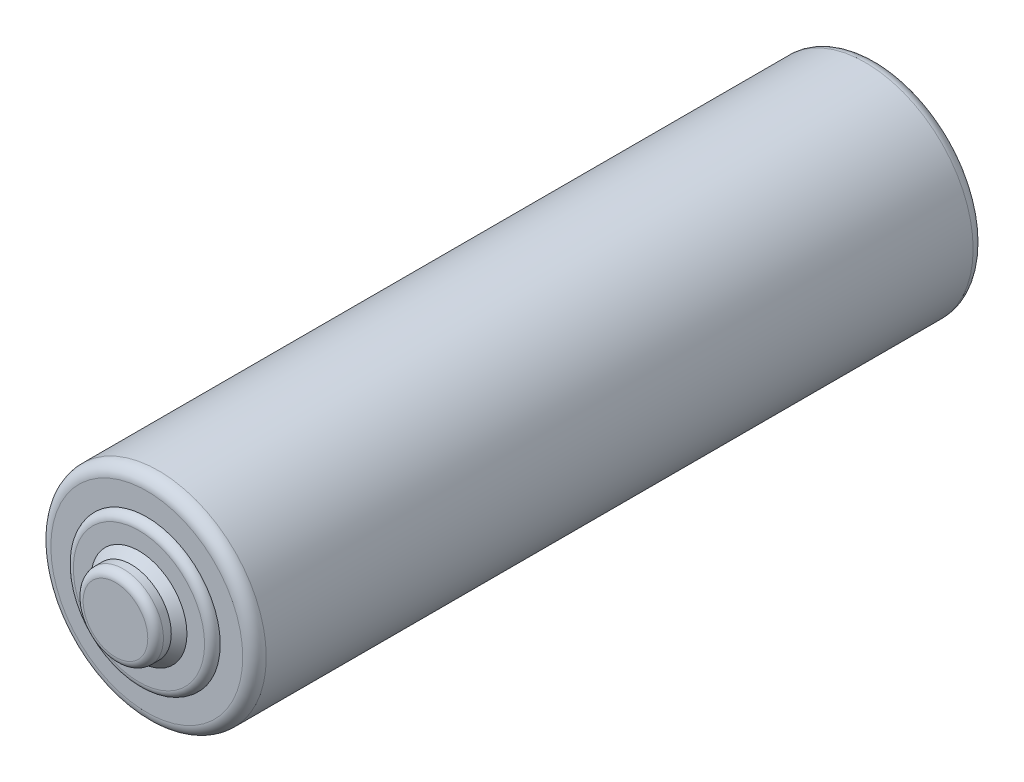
ISO-10303-21;
HEADER;
FILE_DESCRIPTION(('STEP AP214'),'2;1');
FILE_NAME('part.step','',(''),(''),'','','');
FILE_SCHEMA(('AUTOMOTIVE_DESIGN { 1 0 10303 214 1 1 1 1 }'));
ENDSEC;
DATA;
#1=APPLICATION_CONTEXT('core data for automotive mechanical design processes');
#2=APPLICATION_PROTOCOL_DEFINITION('international standard','automotive_design',2000,#1);
#3=PRODUCT_CONTEXT('',#1,'mechanical');
#4=PRODUCT('Part','Part','',(#3));
#5=PRODUCT_RELATED_PRODUCT_CATEGORY('part','',(#4));
#6=PRODUCT_DEFINITION_FORMATION('','',#4);
#7=PRODUCT_DEFINITION_CONTEXT('part definition',#1,'design');
#8=PRODUCT_DEFINITION('design','',#6,#7);
#9=PRODUCT_DEFINITION_SHAPE('','',#8);
#10=(LENGTH_UNIT() NAMED_UNIT(*) SI_UNIT(.MILLI.,.METRE.));
#11=(NAMED_UNIT(*) PLANE_ANGLE_UNIT() SI_UNIT($,.RADIAN.));
#12=(NAMED_UNIT(*) SI_UNIT($,.STERADIAN.) SOLID_ANGLE_UNIT());
#13=UNCERTAINTY_MEASURE_WITH_UNIT(LENGTH_MEASURE(1.E-05),#10,'distance_accuracy_value','');
#14=(GEOMETRIC_REPRESENTATION_CONTEXT(3) GLOBAL_UNCERTAINTY_ASSIGNED_CONTEXT((#13)) GLOBAL_UNIT_ASSIGNED_CONTEXT((#10,
#11,#12)) REPRESENTATION_CONTEXT('',''));
#15=CARTESIAN_POINT('',(0.,0.,0.));
#16=DIRECTION('',(0.,0.,1.));
#17=DIRECTION('',(1.,0.,0.));
#18=AXIS2_PLACEMENT_3D('',#15,#16,#17);
#19=CARTESIAN_POINT('',(0.,0.,0.));
#20=DIRECTION('',(0.,0.,1.));
#21=DIRECTION('',(1.,0.,0.));
#22=AXIS2_PLACEMENT_3D('',#19,#20,#21);
#23=PLANE('',#22);
#24=CARTESIAN_POINT('',(0.,0.,0.));
#25=DIRECTION('',(0.,0.,1.));
#26=DIRECTION('',(1.,0.,0.));
#27=AXIS2_PLACEMENT_3D('',#24,#25,#26);
#28=CIRCLE('',#27,6.223);
#29=CARTESIAN_POINT('',(6.223,0.,0.));
#30=VERTEX_POINT('',#29);
#31=EDGE_CURVE('E41',#30,#30,#28,.F.);
#32=ORIENTED_EDGE('',*,*,#31,.T.);
#33=EDGE_LOOP('',(#32));
#34=FACE_BOUND('',#33,.T.);
#35=CARTESIAN_POINT('',(0.,0.,0.));
#36=DIRECTION('',(0.,0.,1.));
#37=DIRECTION('',(1.,0.,0.));
#38=AXIS2_PLACEMENT_3D('',#35,#36,#37);
#39=CIRCLE('',#38,3.79891603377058);
#40=CARTESIAN_POINT('',(3.79891603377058,0.,0.));
#41=VERTEX_POINT('',#40);
#42=EDGE_CURVE('E52',#41,#41,#39,.F.);
#43=ORIENTED_EDGE('',*,*,#42,.F.);
#44=EDGE_LOOP('',(#43));
#45=FACE_BOUND('',#44,.T.);
#46=ADVANCED_FACE('F34',(#34,#45),#23,.F.);
#47=CARTESIAN_POINT('',(0.,0.,47.879));
#48=DIRECTION('',(0.,0.,1.));
#49=DIRECTION('',(1.,0.,0.));
#50=AXIS2_PLACEMENT_3D('',#47,#48,#49);
#51=PLANE('',#50);
#52=CARTESIAN_POINT('',(0.,0.,47.879));
#53=DIRECTION('',(0.,0.,1.));
#54=DIRECTION('',(1.,0.,0.));
#55=AXIS2_PLACEMENT_3D('',#52,#53,#54);
#56=CIRCLE('',#55,3.1115);
#57=CARTESIAN_POINT('',(3.1115,0.,47.879));
#58=VERTEX_POINT('',#57);
#59=EDGE_CURVE('E62',#58,#58,#56,.F.);
#60=ORIENTED_EDGE('',*,*,#59,.T.);
#61=EDGE_LOOP('',(#60));
#62=FACE_BOUND('',#61,.T.);
#63=CARTESIAN_POINT('',(0.,0.,47.879));
#64=DIRECTION('',(0.,0.,1.));
#65=DIRECTION('',(1.,0.,0.));
#66=AXIS2_PLACEMENT_3D('',#63,#64,#65);
#67=CIRCLE('',#66,4.2545);
#68=CARTESIAN_POINT('',(4.2545,0.,47.879));
#69=VERTEX_POINT('',#68);
#70=EDGE_CURVE('E68',#69,#69,#67,.T.);
#71=ORIENTED_EDGE('',*,*,#70,.T.);
#72=EDGE_LOOP('',(#71));
#73=FACE_BOUND('',#72,.T.);
#74=ADVANCED_FACE('F85',(#62,#73),#51,.T.);
#75=CARTESIAN_POINT('',(0.,0.,47.371));
#76=DIRECTION('',(0.,0.,1.));
#77=DIRECTION('',(1.,0.,0.));
#78=AXIS2_PLACEMENT_3D('',#75,#76,#77);
#79=PLANE('',#78);
#80=CARTESIAN_POINT('',(0.,0.,47.371));
#81=DIRECTION('',(0.,0.,1.));
#82=DIRECTION('',(1.,0.,0.));
#83=AXIS2_PLACEMENT_3D('',#80,#81,#82);
#84=CIRCLE('',#83,6.223);
#85=CARTESIAN_POINT('',(6.223,0.,47.371));
#86=VERTEX_POINT('',#85);
#87=EDGE_CURVE('E59',#86,#86,#84,.T.);
#88=ORIENTED_EDGE('',*,*,#87,.T.);
#89=EDGE_LOOP('',(#88));
#90=FACE_BOUND('',#89,.T.);
#91=CARTESIAN_POINT('',(0.,0.,47.371));
#92=DIRECTION('',(0.,0.,1.));
#93=DIRECTION('',(1.,0.,0.));
#94=AXIS2_PLACEMENT_3D('',#91,#92,#93);
#95=CIRCLE('',#94,4.7625);
#96=CARTESIAN_POINT('',(4.7625,0.,47.371));
#97=VERTEX_POINT('',#96);
#98=EDGE_CURVE('E56',#97,#97,#95,.T.);
#99=ORIENTED_EDGE('',*,*,#98,.F.);
#100=EDGE_LOOP('',(#99));
#101=FACE_BOUND('',#100,.T.);
#102=ADVANCED_FACE('F82',(#90,#101),#79,.T.);
#103=CARTESIAN_POINT('',(0.,0.,47.371));
#104=DIRECTION('',(0.,0.,-1.));
#105=DIRECTION('',(-1.,0.,0.));
#106=AXIS2_PLACEMENT_3D('',#103,#104,#105);
#107=CYLINDRICAL_SURFACE('',#106,6.985);
#108=CARTESIAN_POINT('',(0.,0.,0.761999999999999));
#109=DIRECTION('',(0.,0.,1.));
#110=DIRECTION('',(1.,0.,0.));
#111=AXIS2_PLACEMENT_3D('',#108,#109,#110);
#112=CIRCLE('',#111,6.985);
#113=CARTESIAN_POINT('',(6.985,0.,0.761999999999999));
#114=VERTEX_POINT('',#113);
#115=EDGE_CURVE('E11',#114,#114,#112,.T.);
#116=ORIENTED_EDGE('',*,*,#115,.T.);
#117=EDGE_LOOP('',(#116));
#118=FACE_BOUND('',#117,.T.);
#119=CARTESIAN_POINT('',(0.,0.,46.609));
#120=DIRECTION('',(0.,0.,1.));
#121=DIRECTION('',(1.,0.,0.));
#122=AXIS2_PLACEMENT_3D('',#119,#120,#121);
#123=CIRCLE('',#122,6.985);
#124=CARTESIAN_POINT('',(6.985,0.,46.609));
#125=VERTEX_POINT('',#124);
#126=EDGE_CURVE('E49',#125,#125,#123,.F.);
#127=ORIENTED_EDGE('',*,*,#126,.T.);
#128=EDGE_LOOP('',(#127));
#129=FACE_BOUND('',#128,.T.);
#130=ADVANCED_FACE('F84',(#118,#129),#107,.T.);
#131=CARTESIAN_POINT('',(0.,0.,56.7668100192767));
#132=DIRECTION('',(0.,0.,-1.));
#133=DIRECTION('',(-1.,0.,0.));
#134=AXIS2_PLACEMENT_3D('',#131,#132,#133);
#135=CYLINDRICAL_SURFACE('',#134,2.6035);
#136=CARTESIAN_POINT('',(0.,0.,48.387));
#137=DIRECTION('',(0.,0.,1.));
#138=DIRECTION('',(1.,0.,0.));
#139=AXIS2_PLACEMENT_3D('',#136,#137,#138);
#140=CIRCLE('',#139,2.6035);
#141=CARTESIAN_POINT('',(2.6035,0.,48.387));
#142=VERTEX_POINT('',#141);
#143=EDGE_CURVE('E65',#142,#142,#140,.T.);
#144=ORIENTED_EDGE('',*,*,#143,.T.);
#145=EDGE_LOOP('',(#144));
#146=FACE_BOUND('',#145,.T.);
#147=CARTESIAN_POINT('',(0.,0.,48.895));
#148=DIRECTION('',(0.,0.,1.));
#149=DIRECTION('',(1.,0.,0.));
#150=AXIS2_PLACEMENT_3D('',#147,#148,#149);
#151=CIRCLE('',#150,2.6035);
#152=CARTESIAN_POINT('',(2.6035,0.,48.895));
#153=VERTEX_POINT('',#152);
#154=EDGE_CURVE('E71',#153,#153,#151,.F.);
#155=ORIENTED_EDGE('',*,*,#154,.T.);
#156=EDGE_LOOP('',(#155));
#157=FACE_BOUND('',#156,.T.);
#158=ADVANCED_FACE('F92',(#146,#157),#135,.T.);
#159=CARTESIAN_POINT('',(0.,0.,49.403));
#160=DIRECTION('',(0.,0.,1.));
#161=DIRECTION('',(1.,0.,0.));
#162=AXIS2_PLACEMENT_3D('',#159,#160,#161);
#163=PLANE('',#162);
#164=CARTESIAN_POINT('',(0.,0.,49.403));
#165=DIRECTION('',(0.,0.,1.));
#166=DIRECTION('',(1.,0.,0.));
#167=AXIS2_PLACEMENT_3D('',#164,#165,#166);
#168=CIRCLE('',#167,2.0955);
#169=CARTESIAN_POINT('',(2.0955,0.,49.403));
#170=VERTEX_POINT('',#169);
#171=EDGE_CURVE('E55',#170,#170,#168,.T.);
#172=ORIENTED_EDGE('',*,*,#171,.T.);
#173=EDGE_LOOP('',(#172));
#174=FACE_BOUND('',#173,.T.);
#175=ADVANCED_FACE('F128',(#174),#163,.T.);
#176=CARTESIAN_POINT('',(0.,0.,-0.635));
#177=DIRECTION('',(0.,0.,1.));
#178=DIRECTION('',(1.,0.,0.));
#179=AXIS2_PLACEMENT_3D('',#176,#177,#178);
#180=PLANE('',#179);
#181=CARTESIAN_POINT('',(0.,0.,-0.635));
#182=DIRECTION('',(0.,0.,1.));
#183=DIRECTION('',(1.,0.,0.));
#184=AXIS2_PLACEMENT_3D('',#181,#182,#183);
#185=CIRCLE('',#184,3.04757390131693);
#186=CARTESIAN_POINT('',(3.04757390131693,0.,-0.635));
#187=VERTEX_POINT('',#186);
#188=EDGE_CURVE('E45',#187,#187,#185,.F.);
#189=ORIENTED_EDGE('',*,*,#188,.T.);
#190=EDGE_LOOP('',(#189));
#191=FACE_BOUND('',#190,.T.);
#192=ADVANCED_FACE('F105',(#191),#180,.F.);
#193=CARTESIAN_POINT('',(0.,0.,48.895));
#194=DIRECTION('',(0.,0.,1.));
#195=DIRECTION('',(1.,0.,0.));
#196=AXIS2_PLACEMENT_3D('',#193,#194,#195);
#197=TOROIDAL_SURFACE('',#196,2.0955,0.508);
#198=ORIENTED_EDGE('',*,*,#154,.F.);
#199=EDGE_LOOP('',(#198));
#200=FACE_BOUND('',#199,.T.);
#201=ORIENTED_EDGE('',*,*,#171,.F.);
#202=EDGE_LOOP('',(#201));
#203=FACE_BOUND('',#202,.T.);
#204=ADVANCED_FACE('F102',(#200,#203),#197,.T.);
#205=CARTESIAN_POINT('',(0.,0.,47.371));
#206=DIRECTION('',(0.,0.,1.));
#207=DIRECTION('',(1.,0.,0.));
#208=AXIS2_PLACEMENT_3D('',#205,#206,#207);
#209=TOROIDAL_SURFACE('',#208,4.2545,0.508);
#210=ORIENTED_EDGE('',*,*,#98,.T.);
#211=EDGE_LOOP('',(#210));
#212=FACE_BOUND('',#211,.T.);
#213=ORIENTED_EDGE('',*,*,#70,.F.);
#214=EDGE_LOOP('',(#213));
#215=FACE_BOUND('',#214,.T.);
#216=ADVANCED_FACE('F79',(#212,#215),#209,.T.);
#217=CARTESIAN_POINT('',(0.,0.,48.387));
#218=DIRECTION('',(0.,0.,-1.));
#219=DIRECTION('',(-1.,0.,0.));
#220=AXIS2_PLACEMENT_3D('',#217,#218,#219);
#221=CONICAL_SURFACE('',#220,2.6035,0.785398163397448);
#222=ORIENTED_EDGE('',*,*,#59,.F.);
#223=EDGE_LOOP('',(#222));
#224=FACE_BOUND('',#223,.T.);
#225=ORIENTED_EDGE('',*,*,#143,.F.);
#226=EDGE_LOOP('',(#225));
#227=FACE_BOUND('',#226,.T.);
#228=ADVANCED_FACE('F109',(#224,#227),#221,.T.);
#229=CARTESIAN_POINT('',(0.,0.,46.609));
#230=DIRECTION('',(0.,0.,1.));
#231=DIRECTION('',(1.,0.,0.));
#232=AXIS2_PLACEMENT_3D('',#229,#230,#231);
#233=TOROIDAL_SURFACE('',#232,6.223,0.762);
#234=ORIENTED_EDGE('',*,*,#126,.F.);
#235=EDGE_LOOP('',(#234));
#236=FACE_BOUND('',#235,.T.);
#237=ORIENTED_EDGE('',*,*,#87,.F.);
#238=EDGE_LOOP('',(#237));
#239=FACE_BOUND('',#238,.T.);
#240=ADVANCED_FACE('F112',(#236,#239),#233,.T.);
#241=CARTESIAN_POINT('',(0.,0.,0.127));
#242=DIRECTION('',(0.,0.,-1.));
#243=DIRECTION('',(-1.,0.,0.));
#244=AXIS2_PLACEMENT_3D('',#241,#242,#243);
#245=TOROIDAL_SURFACE('',#244,3.04757390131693,0.762);
#246=ORIENTED_EDGE('',*,*,#188,.F.);
#247=EDGE_LOOP('',(#246));
#248=FACE_BOUND('',#247,.T.);
#249=ORIENTED_EDGE('',*,*,#42,.T.);
#250=EDGE_LOOP('',(#249));
#251=FACE_BOUND('',#250,.T.);
#252=ADVANCED_FACE('F115',(#248,#251),#245,.T.);
#253=CARTESIAN_POINT('',(0.,0.,0.761999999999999));
#254=DIRECTION('',(0.,0.,1.));
#255=DIRECTION('',(1.,0.,0.));
#256=AXIS2_PLACEMENT_3D('',#253,#254,#255);
#257=TOROIDAL_SURFACE('',#256,6.223,0.762);
#258=ORIENTED_EDGE('',*,*,#115,.F.);
#259=EDGE_LOOP('',(#258));
#260=FACE_BOUND('',#259,.T.);
#261=ORIENTED_EDGE('',*,*,#31,.F.);
#262=EDGE_LOOP('',(#261));
#263=FACE_BOUND('',#262,.T.);
#264=ADVANCED_FACE('F36',(#260,#263),#257,.T.);
#265=CLOSED_SHELL('',(#46,#74,#102,#130,#158,#175,#192,#204,#216,#228,#240,#252,#264));
#266=MANIFOLD_SOLID_BREP('B2',#265);
#267=ADVANCED_BREP_SHAPE_REPRESENTATION('',(#18,#266),#14);
#268=SHAPE_DEFINITION_REPRESENTATION(#9,#267);
ENDSEC;
END-ISO-10303-21;
